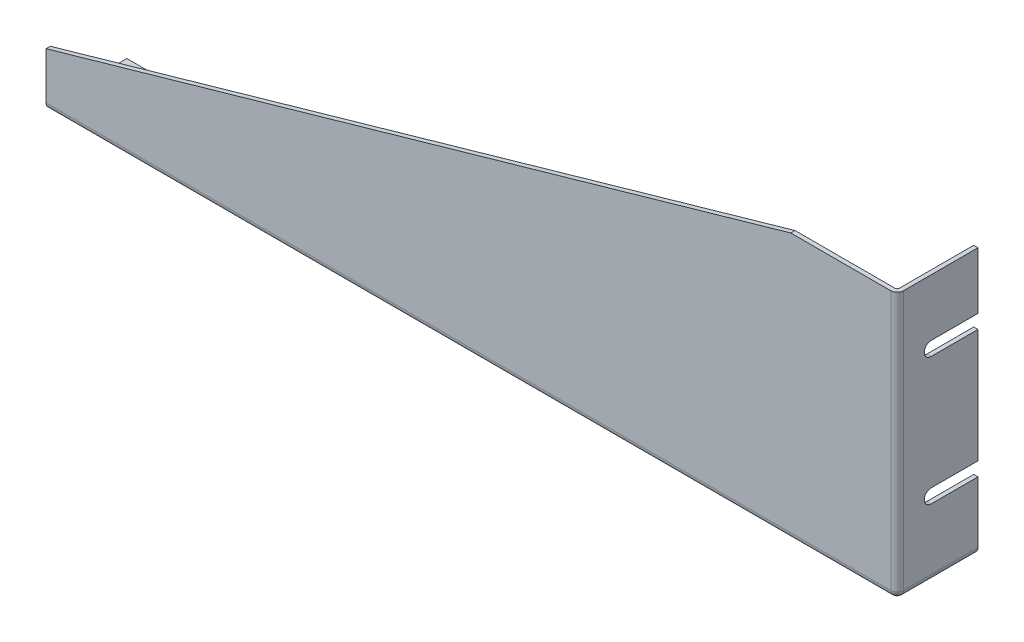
ISO-10303-21;
HEADER;
FILE_DESCRIPTION(('STEP AP214'),'2;1');
FILE_NAME('part.step','',(''),(''),'','','');
FILE_SCHEMA(('AUTOMOTIVE_DESIGN { 1 0 10303 214 1 1 1 1 }'));
ENDSEC;
DATA;
#1=APPLICATION_CONTEXT('core data for automotive mechanical design processes');
#2=APPLICATION_PROTOCOL_DEFINITION('international standard','automotive_design',2000,#1);
#3=PRODUCT_CONTEXT('',#1,'mechanical');
#4=PRODUCT('Part','Part','',(#3));
#5=PRODUCT_RELATED_PRODUCT_CATEGORY('part','',(#4));
#6=PRODUCT_DEFINITION_FORMATION('','',#4);
#7=PRODUCT_DEFINITION_CONTEXT('part definition',#1,'design');
#8=PRODUCT_DEFINITION('design','',#6,#7);
#9=PRODUCT_DEFINITION_SHAPE('','',#8);
#10=(LENGTH_UNIT() NAMED_UNIT(*) SI_UNIT(.MILLI.,.METRE.));
#11=(NAMED_UNIT(*) PLANE_ANGLE_UNIT() SI_UNIT($,.RADIAN.));
#12=(NAMED_UNIT(*) SI_UNIT($,.STERADIAN.) SOLID_ANGLE_UNIT());
#13=UNCERTAINTY_MEASURE_WITH_UNIT(LENGTH_MEASURE(1.E-05),#10,'distance_accuracy_value','');
#14=(GEOMETRIC_REPRESENTATION_CONTEXT(3) GLOBAL_UNCERTAINTY_ASSIGNED_CONTEXT((#13)) GLOBAL_UNIT_ASSIGNED_CONTEXT((#10,
#11,#12)) REPRESENTATION_CONTEXT('',''));
#15=CARTESIAN_POINT('',(0.,0.,0.));
#16=DIRECTION('',(0.,0.,1.));
#17=DIRECTION('',(1.,0.,0.));
#18=AXIS2_PLACEMENT_3D('',#15,#16,#17);
#19=CARTESIAN_POINT('',(0.,0.,-38.));
#20=DIRECTION('',(0.,0.,-1.));
#21=DIRECTION('',(-1.,0.,0.));
#22=AXIS2_PLACEMENT_3D('',#19,#20,#21);
#23=PLANE('',#22);
#24=DIRECTION('',(0.,1.,0.));
#25=VECTOR('',#24,1.);
#26=CARTESIAN_POINT('',(-366.75,35.9999999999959,-37.9999999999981));
#27=LINE('',#26,#25);
#28=CARTESIAN_POINT('',(-366.75,35.9999999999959,-37.9999999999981));
#29=VERTEX_POINT('',#28);
#30=CARTESIAN_POINT('',(-366.75,37.9999999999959,-37.9999999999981));
#31=VERTEX_POINT('',#30);
#32=EDGE_CURVE('E261',#29,#31,#27,.T.);
#33=ORIENTED_EDGE('',*,*,#32,.T.);
#34=DIRECTION('',(-1.,0.,0.));
#35=VECTOR('',#34,1.);
#36=CARTESIAN_POINT('',(0.,37.9999999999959,-38.));
#37=LINE('',#36,#35);
#38=CARTESIAN_POINT('',(-238.25,37.9999999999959,-37.999999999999));
#39=VERTEX_POINT('',#38);
#40=EDGE_CURVE('E915',#39,#31,#37,.T.);
#41=ORIENTED_EDGE('',*,*,#40,.F.);
#42=DIRECTION('',(0.,1.,0.));
#43=VECTOR('',#42,1.);
#44=CARTESIAN_POINT('',(-238.25,35.9999999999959,-37.999999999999));
#45=LINE('',#44,#43);
#46=CARTESIAN_POINT('',(-238.25,35.9999999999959,-38.));
#47=VERTEX_POINT('',#46);
#48=EDGE_CURVE('E275',#47,#39,#45,.T.);
#49=ORIENTED_EDGE('',*,*,#48,.F.);
#50=DIRECTION('',(-1.,0.,0.));
#51=VECTOR('',#50,1.);
#52=CARTESIAN_POINT('',(0.,35.9999999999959,-38.));
#53=LINE('',#52,#51);
#54=EDGE_CURVE('E918',#47,#29,#53,.T.);
#55=ORIENTED_EDGE('',*,*,#54,.T.);
#56=EDGE_LOOP('',(#33,#41,#49,#55));
#57=FACE_BOUND('',#56,.T.);
#58=ADVANCED_FACE('F16',(#57),#23,.T.);
#59=DIRECTION('',(0.,1.,0.));
#60=VECTOR('',#59,1.);
#61=CARTESIAN_POINT('',(-231.75,35.9999999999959,-37.999999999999));
#62=LINE('',#61,#60);
#63=CARTESIAN_POINT('',(-231.75,35.9999999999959,-37.999999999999));
#64=VERTEX_POINT('',#63);
#65=CARTESIAN_POINT('',(-231.75,37.9999999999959,-37.999999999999));
#66=VERTEX_POINT('',#65);
#67=EDGE_CURVE('E282',#64,#66,#62,.T.);
#68=ORIENTED_EDGE('',*,*,#67,.T.);
#69=CARTESIAN_POINT('',(-103.25,37.9999999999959,-38.));
#70=VERTEX_POINT('',#69);
#71=EDGE_CURVE('E385',#70,#66,#37,.T.);
#72=ORIENTED_EDGE('',*,*,#71,.F.);
#73=DIRECTION('',(0.,1.,0.));
#74=VECTOR('',#73,1.);
#75=CARTESIAN_POINT('',(-103.25,35.9999999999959,-38.));
#76=LINE('',#75,#74);
#77=CARTESIAN_POINT('',(-103.25,35.9999999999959,-38.));
#78=VERTEX_POINT('',#77);
#79=EDGE_CURVE('E301',#78,#70,#76,.T.);
#80=ORIENTED_EDGE('',*,*,#79,.F.);
#81=EDGE_CURVE('E377',#78,#64,#53,.T.);
#82=ORIENTED_EDGE('',*,*,#81,.T.);
#83=EDGE_LOOP('',(#68,#72,#80,#82));
#84=FACE_BOUND('',#83,.T.);
#85=ADVANCED_FACE('F533',(#84),#23,.T.);
#86=DIRECTION('',(0.,1.,0.));
#87=VECTOR('',#86,1.);
#88=CARTESIAN_POINT('',(-96.75,35.9999999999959,-38.));
#89=LINE('',#88,#87);
#90=CARTESIAN_POINT('',(-96.75,35.9999999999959,-38.));
#91=VERTEX_POINT('',#90);
#92=CARTESIAN_POINT('',(-96.75,37.9999999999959,-38.));
#93=VERTEX_POINT('',#92);
#94=EDGE_CURVE('E308',#91,#93,#89,.T.);
#95=ORIENTED_EDGE('',*,*,#94,.T.);
#96=CARTESIAN_POINT('',(-43.0000000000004,37.9999999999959,-38.));
#97=VERTEX_POINT('',#96);
#98=EDGE_CURVE('E381',#97,#93,#37,.T.);
#99=ORIENTED_EDGE('',*,*,#98,.F.);
#100=CARTESIAN_POINT('',(-43.0000000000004,38.9999999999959,-38.));
#101=DIRECTION('',(0.,0.,-1.));
#102=DIRECTION('',(-1.,0.,0.));
#103=AXIS2_PLACEMENT_3D('',#100,#101,#102);
#104=CIRCLE('',#103,1.);
#105=CARTESIAN_POINT('',(-42.0000000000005,38.9999999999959,-38.));
#106=VERTEX_POINT('',#105);
#107=EDGE_CURVE('E384',#97,#106,#104,.F.);
#108=ORIENTED_EDGE('',*,*,#107,.T.);
#109=DIRECTION('',(0.,-1.,0.));
#110=VECTOR('',#109,1.);
#111=CARTESIAN_POINT('',(-42.0000000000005,0.,-38.));
#112=LINE('',#111,#110);
#113=CARTESIAN_POINT('',(-42.0000000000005,67.7499999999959,-38.));
#114=VERTEX_POINT('',#113);
#115=EDGE_CURVE('E388',#114,#106,#112,.T.);
#116=ORIENTED_EDGE('',*,*,#115,.F.);
#117=DIRECTION('',(-1.,0.,0.));
#118=VECTOR('',#117,1.);
#119=CARTESIAN_POINT('',(-40.0000000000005,67.7499999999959,-38.));
#120=LINE('',#119,#118);
#121=CARTESIAN_POINT('',(-40.0000000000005,67.7499999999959,-38.));
#122=VERTEX_POINT('',#121);
#123=EDGE_CURVE('E327',#122,#114,#120,.T.);
#124=ORIENTED_EDGE('',*,*,#123,.F.);
#125=DIRECTION('',(0.,-1.,0.));
#126=VECTOR('',#125,1.);
#127=CARTESIAN_POINT('',(-40.0000000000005,0.,-38.));
#128=LINE('',#127,#126);
#129=CARTESIAN_POINT('',(-40.0000000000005,38.9999999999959,-38.));
#130=VERTEX_POINT('',#129);
#131=EDGE_CURVE('E396',#122,#130,#128,.T.);
#132=ORIENTED_EDGE('',*,*,#131,.T.);
#133=CARTESIAN_POINT('',(-43.0000000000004,38.9999999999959,-38.));
#134=DIRECTION('',(0.,0.,-1.));
#135=DIRECTION('',(-1.,0.,0.));
#136=AXIS2_PLACEMENT_3D('',#133,#134,#135);
#137=CIRCLE('',#136,3.);
#138=CARTESIAN_POINT('',(-43.0000000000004,35.9999999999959,-38.));
#139=VERTEX_POINT('',#138);
#140=EDGE_CURVE('E369',#139,#130,#137,.F.);
#141=ORIENTED_EDGE('',*,*,#140,.F.);
#142=EDGE_CURVE('E373',#139,#91,#53,.T.);
#143=ORIENTED_EDGE('',*,*,#142,.T.);
#144=EDGE_LOOP('',(#95,#99,#108,#116,#124,#132,#141,#143));
#145=FACE_BOUND('',#144,.T.);
#146=ADVANCED_FACE('F541',(#145),#23,.T.);
#147=DIRECTION('',(-1.,0.,0.));
#148=VECTOR('',#147,1.);
#149=CARTESIAN_POINT('',(-40.0000000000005,74.2499999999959,-38.));
#150=LINE('',#149,#148);
#151=CARTESIAN_POINT('',(-40.0000000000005,74.2499999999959,-38.));
#152=VERTEX_POINT('',#151);
#153=CARTESIAN_POINT('',(-42.0000000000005,74.2499999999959,-38.));
#154=VERTEX_POINT('',#153);
#155=EDGE_CURVE('E334',#152,#154,#150,.T.);
#156=ORIENTED_EDGE('',*,*,#155,.T.);
#157=CARTESIAN_POINT('',(-42.0000000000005,127.749999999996,-38.));
#158=VERTEX_POINT('',#157);
#159=EDGE_CURVE('E393',#158,#154,#112,.T.);
#160=ORIENTED_EDGE('',*,*,#159,.F.);
#161=DIRECTION('',(-1.,0.,0.));
#162=VECTOR('',#161,1.);
#163=CARTESIAN_POINT('',(-40.,127.749999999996,-38.));
#164=LINE('',#163,#162);
#165=CARTESIAN_POINT('',(-40.0000000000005,127.749999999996,-38.));
#166=VERTEX_POINT('',#165);
#167=EDGE_CURVE('E353',#166,#158,#164,.T.);
#168=ORIENTED_EDGE('',*,*,#167,.F.);
#169=EDGE_CURVE('E401',#166,#152,#128,.T.);
#170=ORIENTED_EDGE('',*,*,#169,.T.);
#171=EDGE_LOOP('',(#156,#160,#168,#170));
#172=FACE_BOUND('',#171,.T.);
#173=ADVANCED_FACE('F561',(#172),#23,.T.);
#174=DIRECTION('',(-1.,0.,0.));
#175=VECTOR('',#174,1.);
#176=CARTESIAN_POINT('',(-40.,134.249999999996,-38.));
#177=LINE('',#176,#175);
#178=CARTESIAN_POINT('',(-40.,134.249999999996,-38.));
#179=VERTEX_POINT('',#178);
#180=CARTESIAN_POINT('',(-42.0000000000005,134.249999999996,-38.));
#181=VERTEX_POINT('',#180);
#182=EDGE_CURVE('E360',#179,#181,#177,.T.);
#183=ORIENTED_EDGE('',*,*,#182,.T.);
#184=CARTESIAN_POINT('',(-42.0000000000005,160.999999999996,-38.));
#185=VERTEX_POINT('',#184);
#186=EDGE_CURVE('E389',#185,#181,#112,.T.);
#187=ORIENTED_EDGE('',*,*,#186,.F.);
#188=DIRECTION('',(1.,0.,0.));
#189=VECTOR('',#188,1.);
#190=CARTESIAN_POINT('',(0.,160.999999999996,-38.));
#191=LINE('',#190,#189);
#192=CARTESIAN_POINT('',(-40.0000000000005,160.999999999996,-38.));
#193=VERTEX_POINT('',#192);
#194=EDGE_CURVE('E392',#185,#193,#191,.T.);
#195=ORIENTED_EDGE('',*,*,#194,.T.);
#196=EDGE_CURVE('E397',#193,#179,#128,.T.);
#197=ORIENTED_EDGE('',*,*,#196,.T.);
#198=EDGE_LOOP('',(#183,#187,#195,#197));
#199=FACE_BOUND('',#198,.T.);
#200=ADVANCED_FACE('F549',(#199),#23,.T.);
#201=CARTESIAN_POINT('',(-40.0000000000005,35.9999999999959,-2.));
#202=DIRECTION('',(1.,0.,0.));
#203=DIRECTION('',(0.,0.,-1.));
#204=AXIS2_PLACEMENT_3D('',#201,#202,#203);
#205=PLANE('',#204);
#206=DIRECTION('',(0.,0.,-1.));
#207=VECTOR('',#206,1.);
#208=CARTESIAN_POINT('',(-40.0000000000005,74.2499999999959,-38.));
#209=LINE('',#208,#207);
#210=CARTESIAN_POINT('',(-40.0000000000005,74.2499999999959,-16.));
#211=VERTEX_POINT('',#210);
#212=EDGE_CURVE('E324',#211,#152,#209,.T.);
#213=ORIENTED_EDGE('',*,*,#212,.T.);
#214=ORIENTED_EDGE('',*,*,#169,.F.);
#215=DIRECTION('',(0.,0.,1.));
#216=VECTOR('',#215,1.);
#217=CARTESIAN_POINT('',(-40.,127.749999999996,-38.));
#218=LINE('',#217,#216);
#219=CARTESIAN_POINT('',(-40.,127.749999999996,-16.));
#220=VERTEX_POINT('',#219);
#221=EDGE_CURVE('E343',#166,#220,#218,.T.);
#222=ORIENTED_EDGE('',*,*,#221,.T.);
#223=CARTESIAN_POINT('',(-40.,130.999999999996,-16.));
#224=DIRECTION('',(-1.,0.,0.));
#225=DIRECTION('',(0.,-1.,0.));
#226=AXIS2_PLACEMENT_3D('',#223,#224,#225);
#227=CIRCLE('',#226,3.25);
#228=CARTESIAN_POINT('',(-40.,134.249999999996,-16.));
#229=VERTEX_POINT('',#228);
#230=EDGE_CURVE('E346',#220,#229,#227,.T.);
#231=ORIENTED_EDGE('',*,*,#230,.T.);
#232=DIRECTION('',(0.,0.,-1.));
#233=VECTOR('',#232,1.);
#234=CARTESIAN_POINT('',(-40.,134.249999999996,-38.));
#235=LINE('',#234,#233);
#236=EDGE_CURVE('E350',#229,#179,#235,.T.);
#237=ORIENTED_EDGE('',*,*,#236,.T.);
#238=ORIENTED_EDGE('',*,*,#196,.F.);
#239=DIRECTION('',(0.,0.,1.));
#240=VECTOR('',#239,1.);
#241=CARTESIAN_POINT('',(-40.0000000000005,160.999999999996,-2.));
#242=LINE('',#241,#240);
#243=CARTESIAN_POINT('',(-40.0000000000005,160.999999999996,-3.));
#244=VERTEX_POINT('',#243);
#245=EDGE_CURVE('E485',#193,#244,#242,.T.);
#246=ORIENTED_EDGE('',*,*,#245,.T.);
#247=DIRECTION('',(0.,1.,0.));
#248=VECTOR('',#247,1.);
#249=CARTESIAN_POINT('',(-40.0000000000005,35.9999999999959,-3.));
#250=LINE('',#249,#248);
#251=CARTESIAN_POINT('',(-40.0000000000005,38.9999999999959,-3.));
#252=VERTEX_POINT('',#251);
#253=EDGE_CURVE('E454',#244,#252,#250,.F.);
#254=ORIENTED_EDGE('',*,*,#253,.T.);
#255=DIRECTION('',(0.,0.,1.));
#256=VECTOR('',#255,1.);
#257=CARTESIAN_POINT('',(-40.0000000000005,38.9999999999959,-38.));
#258=LINE('',#257,#256);
#259=EDGE_CURVE('E400',#130,#252,#258,.T.);
#260=ORIENTED_EDGE('',*,*,#259,.F.);
#261=ORIENTED_EDGE('',*,*,#131,.F.);
#262=DIRECTION('',(0.,0.,1.));
#263=VECTOR('',#262,1.);
#264=CARTESIAN_POINT('',(-40.0000000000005,67.7499999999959,-38.));
#265=LINE('',#264,#263);
#266=CARTESIAN_POINT('',(-40.0000000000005,67.7499999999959,-16.));
#267=VERTEX_POINT('',#266);
#268=EDGE_CURVE('E317',#122,#267,#265,.T.);
#269=ORIENTED_EDGE('',*,*,#268,.T.);
#270=CARTESIAN_POINT('',(-40.0000000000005,70.9999999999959,-16.));
#271=DIRECTION('',(-1.,0.,0.));
#272=DIRECTION('',(0.,-1.,0.));
#273=AXIS2_PLACEMENT_3D('',#270,#271,#272);
#274=CIRCLE('',#273,3.25);
#275=EDGE_CURVE('E320',#267,#211,#274,.T.);
#276=ORIENTED_EDGE('',*,*,#275,.T.);
#277=EDGE_LOOP('',(#213,#214,#222,#231,#237,#238,#246,#254,#260,#261,#269,#276));
#278=FACE_BOUND('',#277,.T.);
#279=ADVANCED_FACE('F507',(#278),#205,.T.);
#280=CARTESIAN_POINT('',(-40.0000000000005,35.9999999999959,-2.));
#281=DIRECTION('',(0.,-1.,0.));
#282=DIRECTION('',(1.,0.,0.));
#283=AXIS2_PLACEMENT_3D('',#280,#281,#282);
#284=PLANE('',#283);
#285=DIRECTION('',(0.,0.,-1.));
#286=VECTOR('',#285,1.);
#287=CARTESIAN_POINT('',(-366.75,35.9999999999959,-37.9999999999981));
#288=LINE('',#287,#286);
#289=CARTESIAN_POINT('',(-366.75,35.9999999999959,-15.9999999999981));
#290=VERTEX_POINT('',#289);
#291=EDGE_CURVE('E247',#290,#29,#288,.T.);
#292=ORIENTED_EDGE('',*,*,#291,.T.);
#293=ORIENTED_EDGE('',*,*,#54,.F.);
#294=DIRECTION('',(0.,0.,1.));
#295=VECTOR('',#294,1.);
#296=CARTESIAN_POINT('',(-238.25,35.9999999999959,-37.999999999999));
#297=LINE('',#296,#295);
#298=CARTESIAN_POINT('',(-238.25,35.9999999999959,-15.999999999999));
#299=VERTEX_POINT('',#298);
#300=EDGE_CURVE('E41',#47,#299,#297,.T.);
#301=ORIENTED_EDGE('',*,*,#300,.T.);
#302=CARTESIAN_POINT('',(-235.,35.9999999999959,-15.999999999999));
#303=DIRECTION('',(0.,1.,0.));
#304=DIRECTION('',(0.,0.,1.));
#305=AXIS2_PLACEMENT_3D('',#302,#303,#304);
#306=CIRCLE('',#305,3.25);
#307=CARTESIAN_POINT('',(-231.75,35.9999999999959,-15.999999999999));
#308=VERTEX_POINT('',#307);
#309=EDGE_CURVE('E268',#299,#308,#306,.T.);
#310=ORIENTED_EDGE('',*,*,#309,.T.);
#311=DIRECTION('',(0.,0.,-1.));
#312=VECTOR('',#311,1.);
#313=CARTESIAN_POINT('',(-231.75,35.9999999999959,-37.999999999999));
#314=LINE('',#313,#312);
#315=EDGE_CURVE('E272',#308,#64,#314,.T.);
#316=ORIENTED_EDGE('',*,*,#315,.T.);
#317=ORIENTED_EDGE('',*,*,#81,.F.);
#318=DIRECTION('',(0.,0.,1.));
#319=VECTOR('',#318,1.);
#320=CARTESIAN_POINT('',(-103.25,35.9999999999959,-38.));
#321=LINE('',#320,#319);
#322=CARTESIAN_POINT('',(-103.25,35.9999999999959,-16.));
#323=VERTEX_POINT('',#322);
#324=EDGE_CURVE('E291',#78,#323,#321,.T.);
#325=ORIENTED_EDGE('',*,*,#324,.T.);
#326=CARTESIAN_POINT('',(-100.,35.9999999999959,-16.));
#327=DIRECTION('',(0.,1.,0.));
#328=DIRECTION('',(0.,0.,1.));
#329=AXIS2_PLACEMENT_3D('',#326,#327,#328);
#330=CIRCLE('',#329,3.25);
#331=CARTESIAN_POINT('',(-96.75,35.9999999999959,-16.));
#332=VERTEX_POINT('',#331);
#333=EDGE_CURVE('E294',#323,#332,#330,.T.);
#334=ORIENTED_EDGE('',*,*,#333,.T.);
#335=DIRECTION('',(0.,0.,-1.));
#336=VECTOR('',#335,1.);
#337=CARTESIAN_POINT('',(-96.75,35.9999999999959,-38.));
#338=LINE('',#337,#336);
#339=EDGE_CURVE('E298',#332,#91,#338,.T.);
#340=ORIENTED_EDGE('',*,*,#339,.T.);
#341=ORIENTED_EDGE('',*,*,#142,.F.);
#342=DIRECTION('',(0.,0.,1.));
#343=VECTOR('',#342,1.);
#344=CARTESIAN_POINT('',(-43.0000000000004,35.9999999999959,-38.));
#345=LINE('',#344,#343);
#346=CARTESIAN_POINT('',(-43.0000000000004,35.9999999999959,-3.));
#347=VERTEX_POINT('',#346);
#348=EDGE_CURVE('E466',#139,#347,#345,.T.);
#349=ORIENTED_EDGE('',*,*,#348,.T.);
#350=DIRECTION('',(1.,0.,0.));
#351=VECTOR('',#350,1.);
#352=CARTESIAN_POINT('',(-40.0000000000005,35.9999999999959,-3.));
#353=LINE('',#352,#351);
#354=CARTESIAN_POINT('',(-440.,35.9999999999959,-3.));
#355=VERTEX_POINT('',#354);
#356=EDGE_CURVE('E450',#347,#355,#353,.F.);
#357=ORIENTED_EDGE('',*,*,#356,.T.);
#358=DIRECTION('',(0.,0.,1.));
#359=VECTOR('',#358,1.);
#360=CARTESIAN_POINT('',(-440.,35.9999999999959,-2.));
#361=LINE('',#360,#359);
#362=CARTESIAN_POINT('',(-440.,35.9999999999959,-38.));
#363=VERTEX_POINT('',#362);
#364=EDGE_CURVE('E463',#363,#355,#361,.T.);
#365=ORIENTED_EDGE('',*,*,#364,.F.);
#366=CARTESIAN_POINT('',(-373.25,35.9999999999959,-38.));
#367=VERTEX_POINT('',#366);
#368=EDGE_CURVE('E252',#367,#363,#53,.T.);
#369=ORIENTED_EDGE('',*,*,#368,.F.);
#370=DIRECTION('',(0.,0.,1.));
#371=VECTOR('',#370,1.);
#372=CARTESIAN_POINT('',(-373.25,35.9999999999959,-37.9999999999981));
#373=LINE('',#372,#371);
#374=CARTESIAN_POINT('',(-373.25,35.9999999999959,-15.9999999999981));
#375=VERTEX_POINT('',#374);
#376=EDGE_CURVE('E33',#367,#375,#373,.T.);
#377=ORIENTED_EDGE('',*,*,#376,.T.);
#378=CARTESIAN_POINT('',(-370.,35.9999999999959,-15.9999999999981));
#379=DIRECTION('',(0.,1.,0.));
#380=DIRECTION('',(0.,0.,1.));
#381=AXIS2_PLACEMENT_3D('',#378,#379,#380);
#382=CIRCLE('',#381,3.25);
#383=EDGE_CURVE('E242',#375,#290,#382,.T.);
#384=ORIENTED_EDGE('',*,*,#383,.T.);
#385=EDGE_LOOP('',(#292,#293,#301,#310,#316,#317,#325,#334,#340,#341,#349,#357,#365,#369,#377,#384));
#386=FACE_BOUND('',#385,.T.);
#387=ADVANCED_FACE('F250',(#386),#284,.T.);
#388=CARTESIAN_POINT('',(-440.,35.9999999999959,-2.));
#389=DIRECTION('',(-1.,0.,0.));
#390=DIRECTION('',(0.,-1.,0.));
#391=AXIS2_PLACEMENT_3D('',#388,#389,#390);
#392=PLANE('',#391);
#393=ORIENTED_EDGE('',*,*,#364,.T.);
#394=CARTESIAN_POINT('',(-440.,38.9999999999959,-3.));
#395=DIRECTION('',(-1.,0.,0.));
#396=DIRECTION('',(0.,-1.,0.));
#397=AXIS2_PLACEMENT_3D('',#394,#395,#396);
#398=CIRCLE('',#397,3.);
#399=CARTESIAN_POINT('',(-440.,38.9999999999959,0.));
#400=VERTEX_POINT('',#399);
#401=EDGE_CURVE('E423',#355,#400,#398,.T.);
#402=ORIENTED_EDGE('',*,*,#401,.T.);
#403=DIRECTION('',(0.,-1.,0.));
#404=VECTOR('',#403,1.);
#405=CARTESIAN_POINT('',(-440.,35.9999999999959,0.));
#406=LINE('',#405,#404);
#407=CARTESIAN_POINT('',(-440.,60.9999999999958,0.));
#408=VERTEX_POINT('',#407);
#409=EDGE_CURVE('E418',#408,#400,#406,.T.);
#410=ORIENTED_EDGE('',*,*,#409,.F.);
#411=DIRECTION('',(0.,0.,1.));
#412=VECTOR('',#411,1.);
#413=CARTESIAN_POINT('',(-440.,60.9999999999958,-2.));
#414=LINE('',#413,#412);
#415=CARTESIAN_POINT('',(-440.,60.9999999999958,-2.));
#416=VERTEX_POINT('',#415);
#417=EDGE_CURVE('E497',#416,#408,#414,.T.);
#418=ORIENTED_EDGE('',*,*,#417,.F.);
#419=DIRECTION('',(0.,-1.,0.));
#420=VECTOR('',#419,1.);
#421=CARTESIAN_POINT('',(-440.,35.9999999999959,-2.));
#422=LINE('',#421,#420);
#423=CARTESIAN_POINT('',(-440.,38.9999999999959,-2.));
#424=VERTEX_POINT('',#423);
#425=EDGE_CURVE('E482',#416,#424,#422,.T.);
#426=ORIENTED_EDGE('',*,*,#425,.T.);
#427=CARTESIAN_POINT('',(-440.,38.9999999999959,-3.));
#428=DIRECTION('',(-1.,0.,0.));
#429=DIRECTION('',(0.,-1.,0.));
#430=AXIS2_PLACEMENT_3D('',#427,#428,#429);
#431=CIRCLE('',#430,1.);
#432=CARTESIAN_POINT('',(-440.,37.9999999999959,-3.));
#433=VERTEX_POINT('',#432);
#434=EDGE_CURVE('E11',#424,#433,#431,.F.);
#435=ORIENTED_EDGE('',*,*,#434,.T.);
#436=DIRECTION('',(0.,0.,1.));
#437=VECTOR('',#436,1.);
#438=CARTESIAN_POINT('',(-440.,37.9999999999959,-38.));
#439=LINE('',#438,#437);
#440=CARTESIAN_POINT('',(-440.,37.9999999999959,-38.));
#441=VERTEX_POINT('',#440);
#442=EDGE_CURVE('E409',#441,#433,#439,.T.);
#443=ORIENTED_EDGE('',*,*,#442,.F.);
#444=DIRECTION('',(0.,1.,0.));
#445=VECTOR('',#444,1.);
#446=CARTESIAN_POINT('',(-440.,-9.76996261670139E-13,-38.));
#447=LINE('',#446,#445);
#448=EDGE_CURVE('E376',#363,#441,#447,.T.);
#449=ORIENTED_EDGE('',*,*,#448,.F.);
#450=EDGE_LOOP('',(#393,#402,#410,#418,#426,#435,#443,#449));
#451=FACE_BOUND('',#450,.T.);
#452=ADVANCED_FACE('F528',(#451),#392,.T.);
#453=CARTESIAN_POINT('',(-440.,60.9999999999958,-2.));
#454=DIRECTION('',(-0.274721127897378,0.961523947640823,0.));
#455=DIRECTION('',(-0.961523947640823,-0.274721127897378,0.));
#456=AXIS2_PLACEMENT_3D('',#453,#454,#455);
#457=PLANE('',#456);
#458=DIRECTION('',(-0.961523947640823,-0.274721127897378,0.));
#459=VECTOR('',#458,1.);
#460=CARTESIAN_POINT('',(-440.,60.9999999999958,0.));
#461=LINE('',#460,#459);
#462=CARTESIAN_POINT('',(-90.,160.999999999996,0.));
#463=VERTEX_POINT('',#462);
#464=EDGE_CURVE('E490',#463,#408,#461,.T.);
#465=ORIENTED_EDGE('',*,*,#464,.F.);
#466=DIRECTION('',(0.,0.,1.));
#467=VECTOR('',#466,1.);
#468=CARTESIAN_POINT('',(-90.,160.999999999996,-2.));
#469=LINE('',#468,#467);
#470=CARTESIAN_POINT('',(-90.,160.999999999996,-2.));
#471=VERTEX_POINT('',#470);
#472=EDGE_CURVE('E498',#471,#463,#469,.T.);
#473=ORIENTED_EDGE('',*,*,#472,.F.);
#474=DIRECTION('',(-0.961523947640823,-0.274721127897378,0.));
#475=VECTOR('',#474,1.);
#476=CARTESIAN_POINT('',(-440.,60.9999999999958,-2.));
#477=LINE('',#476,#475);
#478=EDGE_CURVE('E412',#471,#416,#477,.T.);
#479=ORIENTED_EDGE('',*,*,#478,.T.);
#480=ORIENTED_EDGE('',*,*,#417,.T.);
#481=EDGE_LOOP('',(#465,#473,#479,#480));
#482=FACE_BOUND('',#481,.T.);
#483=ADVANCED_FACE('F518',(#482),#457,.T.);
#484=CARTESIAN_POINT('',(-40.0000000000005,160.999999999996,-2.));
#485=DIRECTION('',(0.,1.,0.));
#486=DIRECTION('',(0.,0.,1.));
#487=AXIS2_PLACEMENT_3D('',#484,#485,#486);
#488=PLANE('',#487);
#489=DIRECTION('',(-1.,0.,0.));
#490=VECTOR('',#489,1.);
#491=CARTESIAN_POINT('',(-40.0000000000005,160.999999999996,0.));
#492=LINE('',#491,#490);
#493=CARTESIAN_POINT('',(-43.0000000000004,160.999999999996,0.));
#494=VERTEX_POINT('',#493);
#495=EDGE_CURVE('E469',#494,#463,#492,.T.);
#496=ORIENTED_EDGE('',*,*,#495,.F.);
#497=CARTESIAN_POINT('',(-43.0000000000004,160.999999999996,-3.));
#498=DIRECTION('',(0.,1.,0.));
#499=DIRECTION('',(0.,0.,1.));
#500=AXIS2_PLACEMENT_3D('',#497,#498,#499);
#501=CIRCLE('',#500,3.);
#502=EDGE_CURVE('E456',#494,#244,#501,.T.);
#503=ORIENTED_EDGE('',*,*,#502,.T.);
#504=ORIENTED_EDGE('',*,*,#245,.F.);
#505=ORIENTED_EDGE('',*,*,#194,.F.);
#506=DIRECTION('',(0.,0.,1.));
#507=VECTOR('',#506,1.);
#508=CARTESIAN_POINT('',(-42.0000000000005,160.999999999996,-38.));
#509=LINE('',#508,#507);
#510=CARTESIAN_POINT('',(-42.0000000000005,160.999999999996,-3.));
#511=VERTEX_POINT('',#510);
#512=EDGE_CURVE('E406',#185,#511,#509,.T.);
#513=ORIENTED_EDGE('',*,*,#512,.T.);
#514=CARTESIAN_POINT('',(-43.0000000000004,160.999999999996,-3.));
#515=DIRECTION('',(0.,1.,0.));
#516=DIRECTION('',(0.,0.,1.));
#517=AXIS2_PLACEMENT_3D('',#514,#515,#516);
#518=CIRCLE('',#517,1.);
#519=CARTESIAN_POINT('',(-43.0000000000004,160.999999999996,-2.));
#520=VERTEX_POINT('',#519);
#521=EDGE_CURVE('E25',#511,#520,#518,.F.);
#522=ORIENTED_EDGE('',*,*,#521,.T.);
#523=DIRECTION('',(-1.,0.,0.));
#524=VECTOR('',#523,1.);
#525=CARTESIAN_POINT('',(-40.0000000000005,160.999999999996,-2.));
#526=LINE('',#525,#524);
#527=EDGE_CURVE('E415',#520,#471,#526,.T.);
#528=ORIENTED_EDGE('',*,*,#527,.T.);
#529=ORIENTED_EDGE('',*,*,#472,.T.);
#530=EDGE_LOOP('',(#496,#503,#504,#505,#513,#522,#528,#529));
#531=FACE_BOUND('',#530,.T.);
#532=ADVANCED_FACE('F515',(#531),#488,.T.);
#533=CARTESIAN_POINT('',(0.,0.,-2.));
#534=DIRECTION('',(0.,0.,1.));
#535=DIRECTION('',(1.,0.,0.));
#536=AXIS2_PLACEMENT_3D('',#533,#534,#535);
#537=PLANE('',#536);
#538=ORIENTED_EDGE('',*,*,#527,.F.);
#539=DIRECTION('',(0.,-1.,0.));
#540=VECTOR('',#539,1.);
#541=CARTESIAN_POINT('',(-43.0000000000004,0.,-2.));
#542=LINE('',#541,#540);
#543=CARTESIAN_POINT('',(-43.0000000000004,38.9999999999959,-2.));
#544=VERTEX_POINT('',#543);
#545=EDGE_CURVE('E422',#520,#544,#542,.T.);
#546=ORIENTED_EDGE('',*,*,#545,.T.);
#547=DIRECTION('',(-1.,0.,0.));
#548=VECTOR('',#547,1.);
#549=CARTESIAN_POINT('',(0.,38.9999999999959,-2.));
#550=LINE('',#549,#548);
#551=EDGE_CURVE('E420',#544,#424,#550,.T.);
#552=ORIENTED_EDGE('',*,*,#551,.T.);
#553=ORIENTED_EDGE('',*,*,#425,.F.);
#554=ORIENTED_EDGE('',*,*,#478,.F.);
#555=EDGE_LOOP('',(#538,#546,#552,#553,#554));
#556=FACE_BOUND('',#555,.T.);
#557=ADVANCED_FACE('F517',(#556),#537,.F.);
#558=CARTESIAN_POINT('',(0.,0.,0.));
#559=DIRECTION('',(0.,0.,1.));
#560=DIRECTION('',(1.,0.,0.));
#561=AXIS2_PLACEMENT_3D('',#558,#559,#560);
#562=PLANE('',#561);
#563=DIRECTION('',(1.,0.,0.));
#564=VECTOR('',#563,1.);
#565=CARTESIAN_POINT('',(0.,38.9999999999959,0.));
#566=LINE('',#565,#564);
#567=CARTESIAN_POINT('',(-43.0000000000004,38.9999999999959,0.));
#568=VERTEX_POINT('',#567);
#569=EDGE_CURVE('E461',#400,#568,#566,.T.);
#570=ORIENTED_EDGE('',*,*,#569,.T.);
#571=DIRECTION('',(0.,1.,0.));
#572=VECTOR('',#571,1.);
#573=CARTESIAN_POINT('',(-43.0000000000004,0.,0.));
#574=LINE('',#573,#572);
#575=EDGE_CURVE('E458',#568,#494,#574,.T.);
#576=ORIENTED_EDGE('',*,*,#575,.T.);
#577=ORIENTED_EDGE('',*,*,#495,.T.);
#578=ORIENTED_EDGE('',*,*,#464,.T.);
#579=ORIENTED_EDGE('',*,*,#409,.T.);
#580=EDGE_LOOP('',(#570,#576,#577,#578,#579));
#581=FACE_BOUND('',#580,.T.);
#582=ADVANCED_FACE('F512',(#581),#562,.T.);
#583=CARTESIAN_POINT('',(-43.0000000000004,38.9999999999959,-38.));
#584=DIRECTION('',(0.,0.,1.));
#585=DIRECTION('',(1.,0.,0.));
#586=AXIS2_PLACEMENT_3D('',#583,#584,#585);
#587=CYLINDRICAL_SURFACE('',#586,3.);
#588=ORIENTED_EDGE('',*,*,#259,.T.);
#589=CARTESIAN_POINT('',(-43.0000000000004,38.9999999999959,-3.));
#590=DIRECTION('',(0.,0.,1.));
#591=DIRECTION('',(1.,0.,0.));
#592=AXIS2_PLACEMENT_3D('',#589,#590,#591);
#593=CIRCLE('',#592,3.);
#594=EDGE_CURVE('E452',#252,#347,#593,.F.);
#595=ORIENTED_EDGE('',*,*,#594,.T.);
#596=ORIENTED_EDGE('',*,*,#348,.F.);
#597=ORIENTED_EDGE('',*,*,#140,.T.);
#598=EDGE_LOOP('',(#588,#595,#596,#597));
#599=FACE_BOUND('',#598,.T.);
#600=ADVANCED_FACE('F588',(#599),#587,.T.);
#601=CARTESIAN_POINT('',(0.,37.9999999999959,-38.));
#602=DIRECTION('',(0.,1.,0.));
#603=DIRECTION('',(0.,0.,1.));
#604=AXIS2_PLACEMENT_3D('',#601,#602,#603);
#605=PLANE('',#604);
#606=DIRECTION('',(0.,0.,-1.));
#607=VECTOR('',#606,1.);
#608=CARTESIAN_POINT('',(-366.75,37.9999999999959,-37.9999999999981));
#609=LINE('',#608,#607);
#610=CARTESIAN_POINT('',(-366.75,37.9999999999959,-15.9999999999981));
#611=VERTEX_POINT('',#610);
#612=EDGE_CURVE('E253',#611,#31,#609,.T.);
#613=ORIENTED_EDGE('',*,*,#612,.F.);
#614=CARTESIAN_POINT('',(-370.,37.9999999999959,-15.9999999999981));
#615=DIRECTION('',(0.,1.,0.));
#616=DIRECTION('',(0.,0.,1.));
#617=AXIS2_PLACEMENT_3D('',#614,#615,#616);
#618=CIRCLE('',#617,3.25);
#619=CARTESIAN_POINT('',(-373.25,37.9999999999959,-15.9999999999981));
#620=VERTEX_POINT('',#619);
#621=EDGE_CURVE('E255',#620,#611,#618,.T.);
#622=ORIENTED_EDGE('',*,*,#621,.F.);
#623=DIRECTION('',(0.,0.,1.));
#624=VECTOR('',#623,1.);
#625=CARTESIAN_POINT('',(-373.25,37.9999999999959,-37.9999999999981));
#626=LINE('',#625,#624);
#627=CARTESIAN_POINT('',(-373.25,37.9999999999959,-37.9999999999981));
#628=VERTEX_POINT('',#627);
#629=EDGE_CURVE('E234',#628,#620,#626,.T.);
#630=ORIENTED_EDGE('',*,*,#629,.F.);
#631=EDGE_CURVE('E380',#628,#441,#37,.T.);
#632=ORIENTED_EDGE('',*,*,#631,.T.);
#633=ORIENTED_EDGE('',*,*,#442,.T.);
#634=DIRECTION('',(-1.,0.,0.));
#635=VECTOR('',#634,1.);
#636=CARTESIAN_POINT('',(0.,37.9999999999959,-3.));
#637=LINE('',#636,#635);
#638=CARTESIAN_POINT('',(-43.0000000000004,37.9999999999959,-3.));
#639=VERTEX_POINT('',#638);
#640=EDGE_CURVE('E430',#433,#639,#637,.F.);
#641=ORIENTED_EDGE('',*,*,#640,.T.);
#642=DIRECTION('',(0.,0.,1.));
#643=VECTOR('',#642,1.);
#644=CARTESIAN_POINT('',(-43.0000000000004,37.9999999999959,-38.));
#645=LINE('',#644,#643);
#646=EDGE_CURVE('E405',#97,#639,#645,.T.);
#647=ORIENTED_EDGE('',*,*,#646,.F.);
#648=ORIENTED_EDGE('',*,*,#98,.T.);
#649=DIRECTION('',(0.,0.,-1.));
#650=VECTOR('',#649,1.);
#651=CARTESIAN_POINT('',(-96.75,37.9999999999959,-38.));
#652=LINE('',#651,#650);
#653=CARTESIAN_POINT('',(-96.75,37.9999999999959,-16.));
#654=VERTEX_POINT('',#653);
#655=EDGE_CURVE('E295',#654,#93,#652,.T.);
#656=ORIENTED_EDGE('',*,*,#655,.F.);
#657=CARTESIAN_POINT('',(-100.,37.9999999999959,-16.));
#658=DIRECTION('',(0.,1.,0.));
#659=DIRECTION('',(0.,0.,1.));
#660=AXIS2_PLACEMENT_3D('',#657,#658,#659);
#661=CIRCLE('',#660,3.25);
#662=CARTESIAN_POINT('',(-103.25,37.9999999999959,-16.));
#663=VERTEX_POINT('',#662);
#664=EDGE_CURVE('E304',#663,#654,#661,.T.);
#665=ORIENTED_EDGE('',*,*,#664,.F.);
#666=DIRECTION('',(0.,0.,1.));
#667=VECTOR('',#666,1.);
#668=CARTESIAN_POINT('',(-103.25,37.9999999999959,-38.));
#669=LINE('',#668,#667);
#670=EDGE_CURVE('E285',#70,#663,#669,.T.);
#671=ORIENTED_EDGE('',*,*,#670,.F.);
#672=ORIENTED_EDGE('',*,*,#71,.T.);
#673=DIRECTION('',(0.,0.,-1.));
#674=VECTOR('',#673,1.);
#675=CARTESIAN_POINT('',(-231.75,37.9999999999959,-37.999999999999));
#676=LINE('',#675,#674);
#677=CARTESIAN_POINT('',(-231.75,37.9999999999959,-15.999999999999));
#678=VERTEX_POINT('',#677);
#679=EDGE_CURVE('E269',#678,#66,#676,.T.);
#680=ORIENTED_EDGE('',*,*,#679,.F.);
#681=CARTESIAN_POINT('',(-235.,37.9999999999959,-15.999999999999));
#682=DIRECTION('',(0.,1.,0.));
#683=DIRECTION('',(0.,0.,1.));
#684=AXIS2_PLACEMENT_3D('',#681,#682,#683);
#685=CIRCLE('',#684,3.25);
#686=CARTESIAN_POINT('',(-238.25,37.9999999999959,-15.999999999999));
#687=VERTEX_POINT('',#686);
#688=EDGE_CURVE('E278',#687,#678,#685,.T.);
#689=ORIENTED_EDGE('',*,*,#688,.F.);
#690=DIRECTION('',(0.,0.,1.));
#691=VECTOR('',#690,1.);
#692=CARTESIAN_POINT('',(-238.25,37.9999999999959,-37.999999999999));
#693=LINE('',#692,#691);
#694=EDGE_CURVE('E264',#39,#687,#693,.T.);
#695=ORIENTED_EDGE('',*,*,#694,.F.);
#696=ORIENTED_EDGE('',*,*,#40,.T.);
#697=EDGE_LOOP('',(#613,#622,#630,#632,#633,#641,#647,#648,#656,#665,#671,#672,#680,#689,#695,#696));
#698=FACE_BOUND('',#697,.T.);
#699=ADVANCED_FACE('F820',(#698),#605,.T.);
#700=CARTESIAN_POINT('',(-43.0000000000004,38.9999999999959,-38.));
#701=DIRECTION('',(0.,0.,1.));
#702=DIRECTION('',(1.,0.,0.));
#703=AXIS2_PLACEMENT_3D('',#700,#701,#702);
#704=CYLINDRICAL_SURFACE('',#703,1.);
#705=ORIENTED_EDGE('',*,*,#646,.T.);
#706=CARTESIAN_POINT('',(-43.0000000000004,38.9999999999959,-3.));
#707=DIRECTION('',(0.,0.,1.));
#708=DIRECTION('',(1.,0.,0.));
#709=AXIS2_PLACEMENT_3D('',#706,#707,#708);
#710=CIRCLE('',#709,1.);
#711=CARTESIAN_POINT('',(-42.0000000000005,38.9999999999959,-3.));
#712=VERTEX_POINT('',#711);
#713=EDGE_CURVE('E428',#639,#712,#710,.T.);
#714=ORIENTED_EDGE('',*,*,#713,.T.);
#715=DIRECTION('',(0.,0.,1.));
#716=VECTOR('',#715,1.);
#717=CARTESIAN_POINT('',(-42.0000000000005,38.9999999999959,-38.));
#718=LINE('',#717,#716);
#719=EDGE_CURVE('E402',#106,#712,#718,.T.);
#720=ORIENTED_EDGE('',*,*,#719,.F.);
#721=ORIENTED_EDGE('',*,*,#107,.F.);
#722=EDGE_LOOP('',(#705,#714,#720,#721));
#723=FACE_BOUND('',#722,.T.);
#724=ADVANCED_FACE('F558',(#723),#704,.F.);
#725=CARTESIAN_POINT('',(-42.0000000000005,0.,-38.));
#726=DIRECTION('',(-1.,0.,0.));
#727=DIRECTION('',(0.,-1.,0.));
#728=AXIS2_PLACEMENT_3D('',#725,#726,#727);
#729=PLANE('',#728);
#730=DIRECTION('',(0.,0.,-1.));
#731=VECTOR('',#730,1.);
#732=CARTESIAN_POINT('',(-42.0000000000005,74.2499999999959,-38.));
#733=LINE('',#732,#731);
#734=CARTESIAN_POINT('',(-42.0000000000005,74.2499999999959,-16.));
#735=VERTEX_POINT('',#734);
#736=EDGE_CURVE('E321',#735,#154,#733,.T.);
#737=ORIENTED_EDGE('',*,*,#736,.F.);
#738=CARTESIAN_POINT('',(-42.0000000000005,70.9999999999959,-16.));
#739=DIRECTION('',(-1.,0.,0.));
#740=DIRECTION('',(0.,-1.,0.));
#741=AXIS2_PLACEMENT_3D('',#738,#739,#740);
#742=CIRCLE('',#741,3.25);
#743=CARTESIAN_POINT('',(-42.0000000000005,67.7499999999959,-16.));
#744=VERTEX_POINT('',#743);
#745=EDGE_CURVE('E330',#744,#735,#742,.T.);
#746=ORIENTED_EDGE('',*,*,#745,.F.);
#747=DIRECTION('',(0.,0.,1.));
#748=VECTOR('',#747,1.);
#749=CARTESIAN_POINT('',(-42.0000000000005,67.7499999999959,-38.));
#750=LINE('',#749,#748);
#751=EDGE_CURVE('E311',#114,#744,#750,.T.);
#752=ORIENTED_EDGE('',*,*,#751,.F.);
#753=ORIENTED_EDGE('',*,*,#115,.T.);
#754=ORIENTED_EDGE('',*,*,#719,.T.);
#755=DIRECTION('',(0.,-1.,0.));
#756=VECTOR('',#755,1.);
#757=CARTESIAN_POINT('',(-42.0000000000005,0.,-3.));
#758=LINE('',#757,#756);
#759=EDGE_CURVE('E426',#712,#511,#758,.F.);
#760=ORIENTED_EDGE('',*,*,#759,.T.);
#761=ORIENTED_EDGE('',*,*,#512,.F.);
#762=ORIENTED_EDGE('',*,*,#186,.T.);
#763=DIRECTION('',(0.,0.,-1.));
#764=VECTOR('',#763,1.);
#765=CARTESIAN_POINT('',(-42.0000000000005,134.249999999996,-38.));
#766=LINE('',#765,#764);
#767=CARTESIAN_POINT('',(-42.0000000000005,134.249999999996,-16.));
#768=VERTEX_POINT('',#767);
#769=EDGE_CURVE('E347',#768,#181,#766,.T.);
#770=ORIENTED_EDGE('',*,*,#769,.F.);
#771=CARTESIAN_POINT('',(-42.0000000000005,130.999999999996,-16.));
#772=DIRECTION('',(-1.,0.,0.));
#773=DIRECTION('',(0.,-1.,0.));
#774=AXIS2_PLACEMENT_3D('',#771,#772,#773);
#775=CIRCLE('',#774,3.25);
#776=CARTESIAN_POINT('',(-42.0000000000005,127.749999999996,-16.));
#777=VERTEX_POINT('',#776);
#778=EDGE_CURVE('E356',#777,#768,#775,.T.);
#779=ORIENTED_EDGE('',*,*,#778,.F.);
#780=DIRECTION('',(0.,0.,1.));
#781=VECTOR('',#780,1.);
#782=CARTESIAN_POINT('',(-42.0000000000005,127.749999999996,-38.));
#783=LINE('',#782,#781);
#784=EDGE_CURVE('E337',#158,#777,#783,.T.);
#785=ORIENTED_EDGE('',*,*,#784,.F.);
#786=ORIENTED_EDGE('',*,*,#159,.T.);
#787=EDGE_LOOP('',(#737,#746,#752,#753,#754,#760,#761,#762,#770,#779,#785,#786));
#788=FACE_BOUND('',#787,.T.);
#789=ADVANCED_FACE('F547',(#788),#729,.T.);
#790=DIRECTION('',(0.,1.,0.));
#791=VECTOR('',#790,1.);
#792=CARTESIAN_POINT('',(-373.25,35.9999999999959,-37.9999999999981));
#793=LINE('',#792,#791);
#794=EDGE_CURVE('E239',#367,#628,#793,.T.);
#795=ORIENTED_EDGE('',*,*,#794,.F.);
#796=ORIENTED_EDGE('',*,*,#368,.T.);
#797=ORIENTED_EDGE('',*,*,#448,.T.);
#798=ORIENTED_EDGE('',*,*,#631,.F.);
#799=EDGE_LOOP('',(#795,#796,#797,#798));
#800=FACE_BOUND('',#799,.T.);
#801=ADVANCED_FACE('F536',(#800),#23,.T.);
#802=CARTESIAN_POINT('',(0.,38.9999999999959,-3.));
#803=DIRECTION('',(1.,0.,0.));
#804=DIRECTION('',(0.,1.,0.));
#805=AXIS2_PLACEMENT_3D('',#802,#803,#804);
#806=CYLINDRICAL_SURFACE('',#805,3.);
#807=ORIENTED_EDGE('',*,*,#401,.F.);
#808=ORIENTED_EDGE('',*,*,#356,.F.);
#809=CARTESIAN_POINT('',(-43.0000000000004,38.9999999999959,-3.));
#810=DIRECTION('',(1.,0.,0.));
#811=DIRECTION('',(0.,1.,0.));
#812=AXIS2_PLACEMENT_3D('',#809,#810,#811);
#813=CIRCLE('',#812,3.);
#814=EDGE_CURVE('E372',#568,#347,#813,.T.);
#815=ORIENTED_EDGE('',*,*,#814,.F.);
#816=ORIENTED_EDGE('',*,*,#569,.F.);
#817=EDGE_LOOP('',(#807,#808,#815,#816));
#818=FACE_BOUND('',#817,.T.);
#819=ADVANCED_FACE('F546',(#818),#806,.T.);
#820=CARTESIAN_POINT('',(-43.0000000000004,38.9999999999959,-3.));
#821=DIRECTION('',(0.,0.,1.));
#822=DIRECTION('',(1.,0.,0.));
#823=AXIS2_PLACEMENT_3D('',#820,#821,#822);
#824=SPHERICAL_SURFACE('',#823,3.);
#825=ORIENTED_EDGE('',*,*,#814,.T.);
#826=ORIENTED_EDGE('',*,*,#594,.F.);
#827=CARTESIAN_POINT('',(-43.0000000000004,38.9999999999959,-3.));
#828=DIRECTION('',(0.,1.,0.));
#829=DIRECTION('',(-1.,0.,0.));
#830=AXIS2_PLACEMENT_3D('',#827,#828,#829);
#831=CIRCLE('',#830,3.);
#832=EDGE_CURVE('E437',#568,#252,#831,.T.);
#833=ORIENTED_EDGE('',*,*,#832,.F.);
#834=EDGE_LOOP('',(#825,#826,#833));
#835=FACE_BOUND('',#834,.T.);
#836=ADVANCED_FACE('F555',(#835),#824,.T.);
#837=CARTESIAN_POINT('',(-43.0000000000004,0.,-3.));
#838=DIRECTION('',(0.,1.,0.));
#839=DIRECTION('',(0.,0.,1.));
#840=AXIS2_PLACEMENT_3D('',#837,#838,#839);
#841=CYLINDRICAL_SURFACE('',#840,3.);
#842=ORIENTED_EDGE('',*,*,#832,.T.);
#843=ORIENTED_EDGE('',*,*,#253,.F.);
#844=ORIENTED_EDGE('',*,*,#502,.F.);
#845=ORIENTED_EDGE('',*,*,#575,.F.);
#846=EDGE_LOOP('',(#842,#843,#844,#845));
#847=FACE_BOUND('',#846,.T.);
#848=ADVANCED_FACE('F510',(#847),#841,.T.);
#849=CARTESIAN_POINT('',(0.,38.9999999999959,-3.));
#850=DIRECTION('',(-1.,0.,0.));
#851=DIRECTION('',(0.,0.,1.));
#852=AXIS2_PLACEMENT_3D('',#849,#850,#851);
#853=CYLINDRICAL_SURFACE('',#852,1.);
#854=CARTESIAN_POINT('',(-43.0000000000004,38.9999999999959,-3.));
#855=DIRECTION('',(-1.,0.,0.));
#856=DIRECTION('',(0.,0.,1.));
#857=AXIS2_PLACEMENT_3D('',#854,#855,#856);
#858=CIRCLE('',#857,1.);
#859=EDGE_CURVE('E20',#639,#544,#858,.T.);
#860=ORIENTED_EDGE('',*,*,#859,.F.);
#861=ORIENTED_EDGE('',*,*,#640,.F.);
#862=ORIENTED_EDGE('',*,*,#434,.F.);
#863=ORIENTED_EDGE('',*,*,#551,.F.);
#864=EDGE_LOOP('',(#860,#861,#862,#863));
#865=FACE_BOUND('',#864,.T.);
#866=ADVANCED_FACE('F18',(#865),#853,.F.);
#867=CARTESIAN_POINT('',(-43.0000000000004,38.9999999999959,-3.));
#868=DIRECTION('',(0.,0.,1.));
#869=DIRECTION('',(1.,0.,0.));
#870=AXIS2_PLACEMENT_3D('',#867,#868,#869);
#871=SPHERICAL_SURFACE('',#870,1.);
#872=ORIENTED_EDGE('',*,*,#713,.F.);
#873=ORIENTED_EDGE('',*,*,#859,.T.);
#874=CARTESIAN_POINT('',(-43.0000000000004,38.9999999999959,-3.));
#875=DIRECTION('',(0.,-1.,0.));
#876=DIRECTION('',(1.,0.,0.));
#877=AXIS2_PLACEMENT_3D('',#874,#875,#876);
#878=CIRCLE('',#877,1.);
#879=EDGE_CURVE('E363',#712,#544,#878,.T.);
#880=ORIENTED_EDGE('',*,*,#879,.F.);
#881=EDGE_LOOP('',(#872,#873,#880));
#882=FACE_BOUND('',#881,.T.);
#883=ADVANCED_FACE('F612',(#882),#871,.F.);
#884=CARTESIAN_POINT('',(-43.0000000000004,0.,-3.));
#885=DIRECTION('',(0.,-1.,0.));
#886=DIRECTION('',(1.,0.,0.));
#887=AXIS2_PLACEMENT_3D('',#884,#885,#886);
#888=CYLINDRICAL_SURFACE('',#887,1.);
#889=ORIENTED_EDGE('',*,*,#521,.F.);
#890=ORIENTED_EDGE('',*,*,#759,.F.);
#891=ORIENTED_EDGE('',*,*,#879,.T.);
#892=ORIENTED_EDGE('',*,*,#545,.F.);
#893=EDGE_LOOP('',(#889,#890,#891,#892));
#894=FACE_BOUND('',#893,.T.);
#895=ADVANCED_FACE('F577',(#894),#888,.F.);
#896=CARTESIAN_POINT('',(-40.,134.249999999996,-38.));
#897=DIRECTION('',(0.,1.,0.));
#898=DIRECTION('',(-1.,0.,0.));
#899=AXIS2_PLACEMENT_3D('',#896,#897,#898);
#900=PLANE('',#899);
#901=ORIENTED_EDGE('',*,*,#769,.T.);
#902=ORIENTED_EDGE('',*,*,#182,.F.);
#903=ORIENTED_EDGE('',*,*,#236,.F.);
#904=DIRECTION('',(-1.,0.,0.));
#905=VECTOR('',#904,1.);
#906=CARTESIAN_POINT('',(-40.,134.249999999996,-16.));
#907=LINE('',#906,#905);
#908=EDGE_CURVE('E364',#229,#768,#907,.T.);
#909=ORIENTED_EDGE('',*,*,#908,.T.);
#910=EDGE_LOOP('',(#901,#902,#903,#909));
#911=FACE_BOUND('',#910,.T.);
#912=ADVANCED_FACE('F619',(#911),#900,.F.);
#913=CARTESIAN_POINT('',(-40.,130.999999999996,-16.));
#914=DIRECTION('',(-1.,0.,0.));
#915=DIRECTION('',(0.,-1.,0.));
#916=AXIS2_PLACEMENT_3D('',#913,#914,#915);
#917=CYLINDRICAL_SURFACE('',#916,3.25);
#918=ORIENTED_EDGE('',*,*,#778,.T.);
#919=ORIENTED_EDGE('',*,*,#908,.F.);
#920=ORIENTED_EDGE('',*,*,#230,.F.);
#921=DIRECTION('',(-1.,0.,0.));
#922=VECTOR('',#921,1.);
#923=CARTESIAN_POINT('',(-40.,127.749999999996,-16.));
#924=LINE('',#923,#922);
#925=EDGE_CURVE('E366',#220,#777,#924,.T.);
#926=ORIENTED_EDGE('',*,*,#925,.T.);
#927=EDGE_LOOP('',(#918,#919,#920,#926));
#928=FACE_BOUND('',#927,.T.);
#929=ADVANCED_FACE('F661',(#928),#917,.F.);
#930=CARTESIAN_POINT('',(-40.,127.749999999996,-38.));
#931=DIRECTION('',(0.,-1.,0.));
#932=DIRECTION('',(1.,0.,0.));
#933=AXIS2_PLACEMENT_3D('',#930,#931,#932);
#934=PLANE('',#933);
#935=ORIENTED_EDGE('',*,*,#784,.T.);
#936=ORIENTED_EDGE('',*,*,#925,.F.);
#937=ORIENTED_EDGE('',*,*,#221,.F.);
#938=ORIENTED_EDGE('',*,*,#167,.T.);
#939=EDGE_LOOP('',(#935,#936,#937,#938));
#940=FACE_BOUND('',#939,.T.);
#941=ADVANCED_FACE('F670',(#940),#934,.F.);
#942=CARTESIAN_POINT('',(-40.0000000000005,74.2499999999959,-38.));
#943=DIRECTION('',(0.,1.,0.));
#944=DIRECTION('',(-1.,0.,0.));
#945=AXIS2_PLACEMENT_3D('',#942,#943,#944);
#946=PLANE('',#945);
#947=ORIENTED_EDGE('',*,*,#736,.T.);
#948=ORIENTED_EDGE('',*,*,#155,.F.);
#949=ORIENTED_EDGE('',*,*,#212,.F.);
#950=DIRECTION('',(-1.,0.,0.));
#951=VECTOR('',#950,1.);
#952=CARTESIAN_POINT('',(-40.0000000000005,74.2499999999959,-16.));
#953=LINE('',#952,#951);
#954=EDGE_CURVE('E338',#211,#735,#953,.T.);
#955=ORIENTED_EDGE('',*,*,#954,.T.);
#956=EDGE_LOOP('',(#947,#948,#949,#955));
#957=FACE_BOUND('',#956,.T.);
#958=ADVANCED_FACE('F604',(#957),#946,.F.);
#959=CARTESIAN_POINT('',(-40.0000000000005,70.9999999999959,-16.));
#960=DIRECTION('',(-1.,0.,0.));
#961=DIRECTION('',(0.,-1.,0.));
#962=AXIS2_PLACEMENT_3D('',#959,#960,#961);
#963=CYLINDRICAL_SURFACE('',#962,3.25);
#964=ORIENTED_EDGE('',*,*,#745,.T.);
#965=ORIENTED_EDGE('',*,*,#954,.F.);
#966=ORIENTED_EDGE('',*,*,#275,.F.);
#967=DIRECTION('',(-1.,0.,0.));
#968=VECTOR('',#967,1.);
#969=CARTESIAN_POINT('',(-40.0000000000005,67.7499999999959,-16.));
#970=LINE('',#969,#968);
#971=EDGE_CURVE('E340',#267,#744,#970,.T.);
#972=ORIENTED_EDGE('',*,*,#971,.T.);
#973=EDGE_LOOP('',(#964,#965,#966,#972));
#974=FACE_BOUND('',#973,.T.);
#975=ADVANCED_FACE('F688',(#974),#963,.F.);
#976=CARTESIAN_POINT('',(-40.0000000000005,67.7499999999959,-38.));
#977=DIRECTION('',(0.,-1.,0.));
#978=DIRECTION('',(1.,0.,0.));
#979=AXIS2_PLACEMENT_3D('',#976,#977,#978);
#980=PLANE('',#979);
#981=ORIENTED_EDGE('',*,*,#751,.T.);
#982=ORIENTED_EDGE('',*,*,#971,.F.);
#983=ORIENTED_EDGE('',*,*,#268,.F.);
#984=ORIENTED_EDGE('',*,*,#123,.T.);
#985=EDGE_LOOP('',(#981,#982,#983,#984));
#986=FACE_BOUND('',#985,.T.);
#987=ADVANCED_FACE('F697',(#986),#980,.F.);
#988=CARTESIAN_POINT('',(-96.75,35.9999999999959,-38.));
#989=DIRECTION('',(1.,0.,0.));
#990=DIRECTION('',(0.,0.,-1.));
#991=AXIS2_PLACEMENT_3D('',#988,#989,#990);
#992=PLANE('',#991);
#993=ORIENTED_EDGE('',*,*,#655,.T.);
#994=ORIENTED_EDGE('',*,*,#94,.F.);
#995=ORIENTED_EDGE('',*,*,#339,.F.);
#996=DIRECTION('',(0.,1.,0.));
#997=VECTOR('',#996,1.);
#998=CARTESIAN_POINT('',(-96.75,35.9999999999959,-16.));
#999=LINE('',#998,#997);
#1000=EDGE_CURVE('E312',#332,#654,#999,.T.);
#1001=ORIENTED_EDGE('',*,*,#1000,.T.);
#1002=EDGE_LOOP('',(#993,#994,#995,#1001));
#1003=FACE_BOUND('',#1002,.T.);
#1004=ADVANCED_FACE('F707',(#1003),#992,.F.);
#1005=CARTESIAN_POINT('',(-100.,35.9999999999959,-16.));
#1006=DIRECTION('',(0.,1.,0.));
#1007=DIRECTION('',(0.,0.,1.));
#1008=AXIS2_PLACEMENT_3D('',#1005,#1006,#1007);
#1009=CYLINDRICAL_SURFACE('',#1008,3.25);
#1010=ORIENTED_EDGE('',*,*,#664,.T.);
#1011=ORIENTED_EDGE('',*,*,#1000,.F.);
#1012=ORIENTED_EDGE('',*,*,#333,.F.);
#1013=DIRECTION('',(0.,1.,0.));
#1014=VECTOR('',#1013,1.);
#1015=CARTESIAN_POINT('',(-103.25,35.9999999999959,-16.));
#1016=LINE('',#1015,#1014);
#1017=EDGE_CURVE('E314',#323,#663,#1016,.T.);
#1018=ORIENTED_EDGE('',*,*,#1017,.T.);
#1019=EDGE_LOOP('',(#1010,#1011,#1012,#1018));
#1020=FACE_BOUND('',#1019,.T.);
#1021=ADVANCED_FACE('F718',(#1020),#1009,.F.);
#1022=CARTESIAN_POINT('',(-103.25,35.9999999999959,-38.));
#1023=DIRECTION('',(-1.,0.,0.));
#1024=DIRECTION('',(0.,0.,1.));
#1025=AXIS2_PLACEMENT_3D('',#1022,#1023,#1024);
#1026=PLANE('',#1025);
#1027=ORIENTED_EDGE('',*,*,#670,.T.);
#1028=ORIENTED_EDGE('',*,*,#1017,.F.);
#1029=ORIENTED_EDGE('',*,*,#324,.F.);
#1030=ORIENTED_EDGE('',*,*,#79,.T.);
#1031=EDGE_LOOP('',(#1027,#1028,#1029,#1030));
#1032=FACE_BOUND('',#1031,.T.);
#1033=ADVANCED_FACE('F729',(#1032),#1026,.F.);
#1034=CARTESIAN_POINT('',(-231.75,35.9999999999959,-37.999999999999));
#1035=DIRECTION('',(1.,0.,0.));
#1036=DIRECTION('',(0.,0.,-1.));
#1037=AXIS2_PLACEMENT_3D('',#1034,#1035,#1036);
#1038=PLANE('',#1037);
#1039=ORIENTED_EDGE('',*,*,#679,.T.);
#1040=ORIENTED_EDGE('',*,*,#67,.F.);
#1041=ORIENTED_EDGE('',*,*,#315,.F.);
#1042=DIRECTION('',(0.,1.,0.));
#1043=VECTOR('',#1042,1.);
#1044=CARTESIAN_POINT('',(-231.75,35.9999999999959,-15.999999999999));
#1045=LINE('',#1044,#1043);
#1046=EDGE_CURVE('E286',#308,#678,#1045,.T.);
#1047=ORIENTED_EDGE('',*,*,#1046,.T.);
#1048=EDGE_LOOP('',(#1039,#1040,#1041,#1047));
#1049=FACE_BOUND('',#1048,.T.);
#1050=ADVANCED_FACE('F739',(#1049),#1038,.F.);
#1051=CARTESIAN_POINT('',(-235.,35.9999999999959,-15.999999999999));
#1052=DIRECTION('',(0.,1.,0.));
#1053=DIRECTION('',(0.,0.,1.));
#1054=AXIS2_PLACEMENT_3D('',#1051,#1052,#1053);
#1055=CYLINDRICAL_SURFACE('',#1054,3.25);
#1056=ORIENTED_EDGE('',*,*,#688,.T.);
#1057=ORIENTED_EDGE('',*,*,#1046,.F.);
#1058=ORIENTED_EDGE('',*,*,#309,.F.);
#1059=DIRECTION('',(0.,1.,0.));
#1060=VECTOR('',#1059,1.);
#1061=CARTESIAN_POINT('',(-238.25,35.9999999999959,-15.999999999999));
#1062=LINE('',#1061,#1060);
#1063=EDGE_CURVE('E288',#299,#687,#1062,.T.);
#1064=ORIENTED_EDGE('',*,*,#1063,.T.);
#1065=EDGE_LOOP('',(#1056,#1057,#1058,#1064));
#1066=FACE_BOUND('',#1065,.T.);
#1067=ADVANCED_FACE('F749',(#1066),#1055,.F.);
#1068=CARTESIAN_POINT('',(-238.25,35.9999999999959,-37.999999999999));
#1069=DIRECTION('',(-1.,0.,0.));
#1070=DIRECTION('',(0.,0.,1.));
#1071=AXIS2_PLACEMENT_3D('',#1068,#1069,#1070);
#1072=PLANE('',#1071);
#1073=ORIENTED_EDGE('',*,*,#694,.T.);
#1074=ORIENTED_EDGE('',*,*,#1063,.F.);
#1075=ORIENTED_EDGE('',*,*,#300,.F.);
#1076=ORIENTED_EDGE('',*,*,#48,.T.);
#1077=EDGE_LOOP('',(#1073,#1074,#1075,#1076));
#1078=FACE_BOUND('',#1077,.T.);
#1079=ADVANCED_FACE('F759',(#1078),#1072,.F.);
#1080=CARTESIAN_POINT('',(-366.75,35.9999999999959,-37.9999999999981));
#1081=DIRECTION('',(1.,0.,0.));
#1082=DIRECTION('',(0.,0.,-1.));
#1083=AXIS2_PLACEMENT_3D('',#1080,#1081,#1082);
#1084=PLANE('',#1083);
#1085=ORIENTED_EDGE('',*,*,#612,.T.);
#1086=ORIENTED_EDGE('',*,*,#32,.F.);
#1087=ORIENTED_EDGE('',*,*,#291,.F.);
#1088=DIRECTION('',(0.,1.,0.));
#1089=VECTOR('',#1088,1.);
#1090=CARTESIAN_POINT('',(-366.75,35.9999999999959,-15.9999999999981));
#1091=LINE('',#1090,#1089);
#1092=EDGE_CURVE('E238',#290,#611,#1091,.T.);
#1093=ORIENTED_EDGE('',*,*,#1092,.T.);
#1094=EDGE_LOOP('',(#1085,#1086,#1087,#1093));
#1095=FACE_BOUND('',#1094,.T.);
#1096=ADVANCED_FACE('F769',(#1095),#1084,.F.);
#1097=CARTESIAN_POINT('',(-370.,35.9999999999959,-15.9999999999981));
#1098=DIRECTION('',(0.,1.,0.));
#1099=DIRECTION('',(0.,0.,1.));
#1100=AXIS2_PLACEMENT_3D('',#1097,#1098,#1099);
#1101=CYLINDRICAL_SURFACE('',#1100,3.25);
#1102=ORIENTED_EDGE('',*,*,#621,.T.);
#1103=ORIENTED_EDGE('',*,*,#1092,.F.);
#1104=ORIENTED_EDGE('',*,*,#383,.F.);
#1105=DIRECTION('',(0.,1.,0.));
#1106=VECTOR('',#1105,1.);
#1107=CARTESIAN_POINT('',(-373.25,35.9999999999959,-15.9999999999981));
#1108=LINE('',#1107,#1106);
#1109=EDGE_CURVE('E230',#375,#620,#1108,.T.);
#1110=ORIENTED_EDGE('',*,*,#1109,.T.);
#1111=EDGE_LOOP('',(#1102,#1103,#1104,#1110));
#1112=FACE_BOUND('',#1111,.T.);
#1113=ADVANCED_FACE('F243',(#1112),#1101,.F.);
#1114=CARTESIAN_POINT('',(-373.25,35.9999999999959,-37.9999999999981));
#1115=DIRECTION('',(-1.,0.,0.));
#1116=DIRECTION('',(0.,0.,1.));
#1117=AXIS2_PLACEMENT_3D('',#1114,#1115,#1116);
#1118=PLANE('',#1117);
#1119=ORIENTED_EDGE('',*,*,#629,.T.);
#1120=ORIENTED_EDGE('',*,*,#1109,.F.);
#1121=ORIENTED_EDGE('',*,*,#376,.F.);
#1122=ORIENTED_EDGE('',*,*,#794,.T.);
#1123=EDGE_LOOP('',(#1119,#1120,#1121,#1122));
#1124=FACE_BOUND('',#1123,.T.);
#1125=ADVANCED_FACE('F232',(#1124),#1118,.F.);
#1126=CLOSED_SHELL('',(#58,#85,#146,#173,#200,#279,#387,#452,#483,#532,#557,#582,#600,#699,#724,
#789,#801,#819,#836,#848,#866,#883,#895,#912,#929,#941,#958,#975,#987,#1004,#1021,#1033,#1050,
#1067,#1079,#1096,#1113,#1125));
#1127=MANIFOLD_SOLID_BREP('B1',#1126);
#1128=ADVANCED_BREP_SHAPE_REPRESENTATION('',(#18,#1127),#14);
#1129=SHAPE_DEFINITION_REPRESENTATION(#9,#1128);
ENDSEC;
END-ISO-10303-21;
